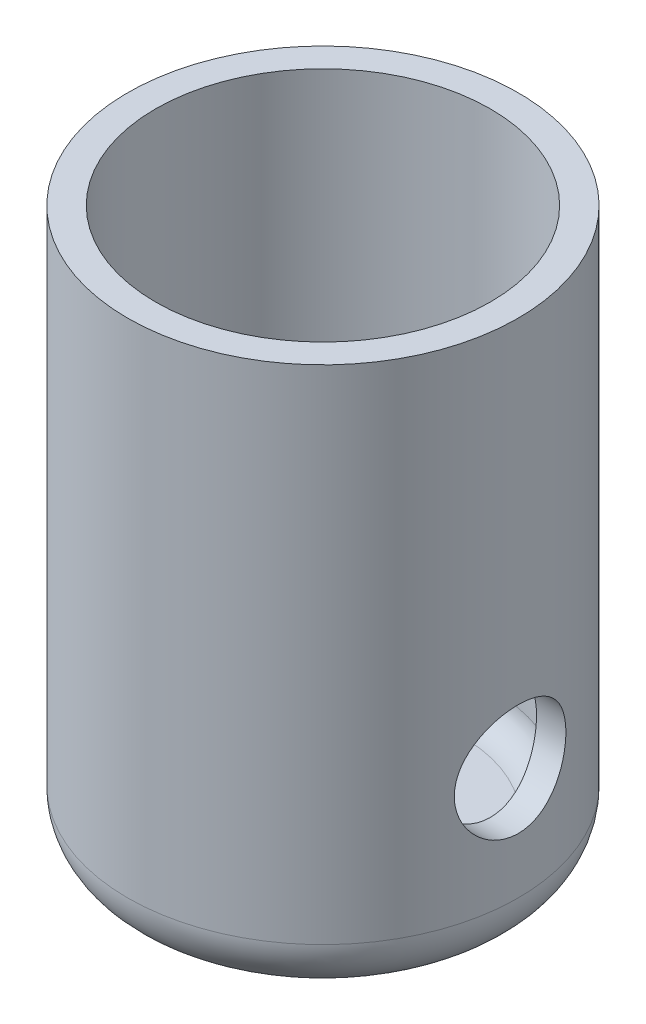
from build123d import *

# Parameters (mm, degrees)
COQUE1_T                     = -0.5
ENL_V_MAT_EXTRU_1_DEPTH      = 25.679051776
ENL_V_MAT_EXTRU_1_DEPTH_BACK = 25.679051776
ESQUISSE2_R                  = 1


with BuildPart() as part:
    # Esquisse1 → R_volution1 (revolve)
    with BuildSketch(Plane.XY, mode=Mode.PRIVATE) as r_volution1_sk:
        with BuildLine():
            Line((0.389028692, 23.28535702), (0.389028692, 14.28535702))
            ThreePointArc((0.389028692, 14.28535702), (0.681921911, 13.578250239), (1.389028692, 13.28535702))
            Line((1.389028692, 13.28535702), (3.889028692, 13.28535702))
            Line((3.889028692, 13.28535702), (3.889028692, 23.28535702))
            Line((3.889028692, 23.28535702), (0.389028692, 23.28535702))
        make_face()
    revolve(r_volution1_sk.sketch.rotate(Axis((3.889028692, 30.794983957, 0), (0, -1, 0)), 270), axis=Axis((3.889028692, 30.794983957, 0), (0, -1, 0)))

    # Coque1
    coque1_openings = [part.faces().sort_by_distance(p)[0] for p in [
        (3.889028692, 23.28535702, 0),
    ]]
    offset(amount=COQUE1_T, openings=coque1_openings, kind=Kind.INTERSECTION)

    # Esquisse2 → Enl_v. mat.-Extru.1 (cut, two sides: drawn at the far end of the back side and taken through both)
    with BuildSketch(Plane(origin=(0, 0, 0), x_dir=(0, 0, -1), z_dir=(1, 0, 0)).offset(-ENL_V_MAT_EXTRU_1_DEPTH_BACK)):
        with Locations(Location((0, 16.28535702, 0), (0, 0, 180))):
            Circle(ESQUISSE2_R)
    extrude(amount=ENL_V_MAT_EXTRU_1_DEPTH + ENL_V_MAT_EXTRU_1_DEPTH_BACK, mode=Mode.SUBTRACT)


solid = part.part
